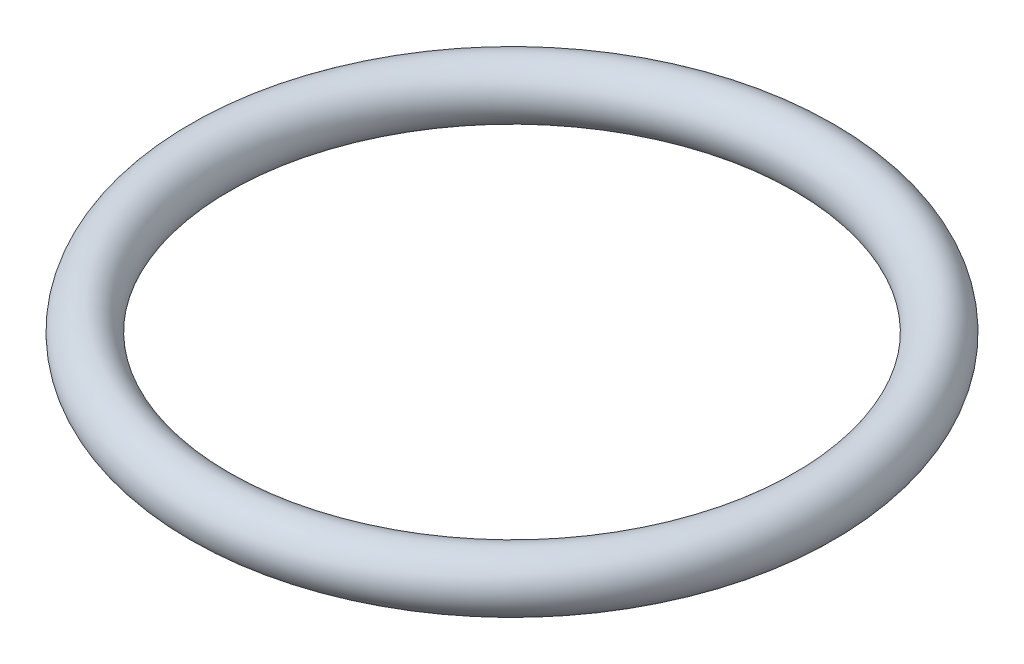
ISO-10303-21;
HEADER;
FILE_DESCRIPTION(('STEP AP214'),'2;1');
FILE_NAME('part.step','',(''),(''),'','','');
FILE_SCHEMA(('AUTOMOTIVE_DESIGN { 1 0 10303 214 1 1 1 1 }'));
ENDSEC;
DATA;
#1=APPLICATION_CONTEXT('core data for automotive mechanical design processes');
#2=APPLICATION_PROTOCOL_DEFINITION('international standard','automotive_design',2000,#1);
#3=PRODUCT_CONTEXT('',#1,'mechanical');
#4=PRODUCT('Part','Part','',(#3));
#5=PRODUCT_RELATED_PRODUCT_CATEGORY('part','',(#4));
#6=PRODUCT_DEFINITION_FORMATION('','',#4);
#7=PRODUCT_DEFINITION_CONTEXT('part definition',#1,'design');
#8=PRODUCT_DEFINITION('design','',#6,#7);
#9=PRODUCT_DEFINITION_SHAPE('','',#8);
#10=(LENGTH_UNIT() NAMED_UNIT(*) SI_UNIT(.MILLI.,.METRE.));
#11=(NAMED_UNIT(*) PLANE_ANGLE_UNIT() SI_UNIT($,.RADIAN.));
#12=(NAMED_UNIT(*) SI_UNIT($,.STERADIAN.) SOLID_ANGLE_UNIT());
#13=UNCERTAINTY_MEASURE_WITH_UNIT(LENGTH_MEASURE(1.E-05),#10,'distance_accuracy_value','');
#14=(GEOMETRIC_REPRESENTATION_CONTEXT(3) GLOBAL_UNCERTAINTY_ASSIGNED_CONTEXT((#13)) GLOBAL_UNIT_ASSIGNED_CONTEXT((#10,
#11,#12)) REPRESENTATION_CONTEXT('',''));
#15=CARTESIAN_POINT('',(0.,0.,0.));
#16=DIRECTION('',(0.,0.,1.));
#17=DIRECTION('',(1.,0.,0.));
#18=AXIS2_PLACEMENT_3D('',#15,#16,#17);
#19=CARTESIAN_POINT('',(0.,2.,0.));
#20=DIRECTION('',(0.,-1.,0.));
#21=DIRECTION('',(0.,0.,-1.));
#22=AXIS2_PLACEMENT_3D('',#19,#20,#21);
#23=TOROIDAL_SURFACE('',#22,22.,2.);
#24=CARTESIAN_POINT('',(0.,2.,-24.));
#25=VERTEX_POINT('',#24);
#26=VERTEX_LOOP('',#25);
#27=FACE_BOUND('',#26,.T.);
#28=ADVANCED_FACE('F30',(#27),#23,.T.);
#29=CLOSED_SHELL('',(#28));
#30=MANIFOLD_SOLID_BREP('B2',#29);
#31=ADVANCED_BREP_SHAPE_REPRESENTATION('',(#18,#30),#14);
#32=SHAPE_DEFINITION_REPRESENTATION(#9,#31);
ENDSEC;
END-ISO-10303-21;
